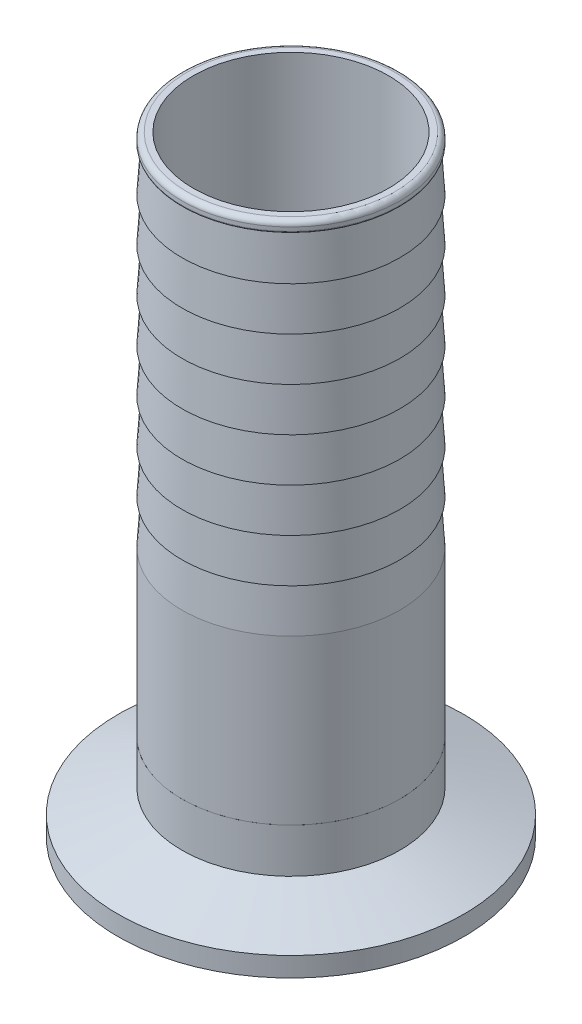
ISO-10303-21;
HEADER;
FILE_DESCRIPTION(('STEP AP214'),'2;1');
FILE_NAME('part.step','',(''),(''),'','','');
FILE_SCHEMA(('AUTOMOTIVE_DESIGN { 1 0 10303 214 1 1 1 1 }'));
ENDSEC;
DATA;
#1=APPLICATION_CONTEXT('core data for automotive mechanical design processes');
#2=APPLICATION_PROTOCOL_DEFINITION('international standard','automotive_design',2000,#1);
#3=PRODUCT_CONTEXT('',#1,'mechanical');
#4=PRODUCT('Part','Part','',(#3));
#5=PRODUCT_RELATED_PRODUCT_CATEGORY('part','',(#4));
#6=PRODUCT_DEFINITION_FORMATION('','',#4);
#7=PRODUCT_DEFINITION_CONTEXT('part definition',#1,'design');
#8=PRODUCT_DEFINITION('design','',#6,#7);
#9=PRODUCT_DEFINITION_SHAPE('','',#8);
#10=(LENGTH_UNIT() NAMED_UNIT(*) SI_UNIT(.MILLI.,.METRE.));
#11=(NAMED_UNIT(*) PLANE_ANGLE_UNIT() SI_UNIT($,.RADIAN.));
#12=(NAMED_UNIT(*) SI_UNIT($,.STERADIAN.) SOLID_ANGLE_UNIT());
#13=UNCERTAINTY_MEASURE_WITH_UNIT(LENGTH_MEASURE(1.E-05),#10,'distance_accuracy_value','');
#14=(GEOMETRIC_REPRESENTATION_CONTEXT(3) GLOBAL_UNCERTAINTY_ASSIGNED_CONTEXT((#13)) GLOBAL_UNIT_ASSIGNED_CONTEXT((#10,
#11,#12)) REPRESENTATION_CONTEXT('',''));
#15=CARTESIAN_POINT('',(0.,0.,0.));
#16=DIRECTION('',(0.,0.,1.));
#17=DIRECTION('',(1.,0.,0.));
#18=AXIS2_PLACEMENT_3D('',#15,#16,#17);
#19=CARTESIAN_POINT('',(22.5114267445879,21.9287540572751,40.3655220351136));
#20=DIRECTION('',(0.,1.,0.));
#21=DIRECTION('',(0.,0.,1.));
#22=AXIS2_PLACEMENT_3D('',#19,#20,#21);
#23=CONICAL_SURFACE('',#22,20.9336326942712,0.401425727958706);
#24=CARTESIAN_POINT('',(22.5114267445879,21.4090179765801,40.3655220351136));
#25=DIRECTION('',(0.,-1.,0.));
#26=DIRECTION('',(0.,0.,-1.));
#27=AXIS2_PLACEMENT_3D('',#24,#25,#26);
#28=CIRCLE('',#27,20.7130178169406);
#29=CARTESIAN_POINT('',(22.5114267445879,21.4090179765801,19.652504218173));
#30=VERTEX_POINT('',#29);
#31=EDGE_CURVE('P0_E10',#30,#30,#28,.T.);
#32=ORIENTED_EDGE('',*,*,#31,.F.);
#33=EDGE_LOOP('',(#32));
#34=FACE_BOUND('',#33,.T.);
#35=CARTESIAN_POINT('',(22.5114267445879,21.9287540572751,40.3655220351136));
#36=DIRECTION('',(0.,-1.,0.));
#37=DIRECTION('',(0.,0.,-1.));
#38=AXIS2_PLACEMENT_3D('',#35,#36,#37);
#39=CIRCLE('',#38,20.9336326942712);
#40=CARTESIAN_POINT('',(22.5114267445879,21.9287540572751,19.4318893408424));
#41=VERTEX_POINT('',#40);
#42=EDGE_CURVE('P0_E55',#41,#41,#39,.T.);
#43=ORIENTED_EDGE('',*,*,#42,.T.);
#44=EDGE_LOOP('',(#43));
#45=FACE_BOUND('',#44,.T.);
#46=ADVANCED_FACE('P0_F15',(#34,#45),#23,.T.);
#47=CARTESIAN_POINT('',(22.5114267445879,21.7067550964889,40.3655220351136));
#48=DIRECTION('',(0.,-1.,0.));
#49=DIRECTION('',(0.,0.,-1.));
#50=AXIS2_PLACEMENT_3D('',#47,#48,#49);
#51=TOROIDAL_SURFACE('',#50,20.0115931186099,0.761999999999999);
#52=CARTESIAN_POINT('',(22.5114267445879,20.9447550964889,40.3655220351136));
#53=DIRECTION('',(0.,-1.,0.));
#54=DIRECTION('',(0.,0.,-1.));
#55=AXIS2_PLACEMENT_3D('',#52,#53,#54);
#56=CIRCLE('',#55,20.0115931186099);
#57=CARTESIAN_POINT('',(22.5114267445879,20.9447550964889,20.3539289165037));
#58=VERTEX_POINT('',#57);
#59=EDGE_CURVE('P0_E21',#58,#58,#56,.T.);
#60=ORIENTED_EDGE('',*,*,#59,.F.);
#61=EDGE_LOOP('',(#60));
#62=FACE_BOUND('',#61,.T.);
#63=ORIENTED_EDGE('',*,*,#31,.T.);
#64=EDGE_LOOP('',(#63));
#65=FACE_BOUND('',#64,.T.);
#66=ADVANCED_FACE('P0_F85',(#62,#65),#51,.T.);
#67=CARTESIAN_POINT('',(22.5114267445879,20.9447550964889,40.3655220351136));
#68=DIRECTION('',(0.,1.,0.));
#69=DIRECTION('',(0.,0.,1.));
#70=AXIS2_PLACEMENT_3D('',#67,#68,#69);
#71=PLANE('',#70);
#72=CARTESIAN_POINT('',(22.5114267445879,20.9447550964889,40.3655220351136));
#73=DIRECTION('',(0.,-1.,0.));
#74=DIRECTION('',(0.,0.,-1.));
#75=AXIS2_PLACEMENT_3D('',#72,#73,#74);
#76=CIRCLE('',#75,14.224);
#77=CARTESIAN_POINT('',(22.5114267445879,20.9447550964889,26.1415220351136));
#78=VERTEX_POINT('',#77);
#79=EDGE_CURVE('P0_E25',#78,#78,#76,.T.);
#80=ORIENTED_EDGE('',*,*,#79,.F.);
#81=EDGE_LOOP('',(#80));
#82=FACE_BOUND('',#81,.T.);
#83=ORIENTED_EDGE('',*,*,#59,.T.);
#84=EDGE_LOOP('',(#83));
#85=FACE_BOUND('',#84,.T.);
#86=ADVANCED_FACE('P0_F90',(#82,#85),#71,.F.);
#87=CARTESIAN_POINT('',(22.5114267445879,20.9447550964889,40.3655220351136));
#88=DIRECTION('',(0.,-1.,0.));
#89=DIRECTION('',(0.,0.,-1.));
#90=AXIS2_PLACEMENT_3D('',#87,#88,#89);
#91=CYLINDRICAL_SURFACE('',#90,14.224);
#92=ORIENTED_EDGE('',*,*,#79,.T.);
#93=EDGE_LOOP('',(#92));
#94=FACE_BOUND('',#93,.T.);
#95=CARTESIAN_POINT('',(22.5114267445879,33.6447550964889,40.3655220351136));
#96=DIRECTION('',(0.,-1.,0.));
#97=DIRECTION('',(0.,0.,-1.));
#98=AXIS2_PLACEMENT_3D('',#95,#96,#97);
#99=CIRCLE('',#98,14.224);
#100=CARTESIAN_POINT('',(22.5114267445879,33.6447550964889,26.1415220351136));
#101=VERTEX_POINT('',#100);
#102=EDGE_CURVE('P0_E29',#101,#101,#99,.T.);
#103=ORIENTED_EDGE('',*,*,#102,.F.);
#104=EDGE_LOOP('',(#103));
#105=FACE_BOUND('',#104,.T.);
#106=ADVANCED_FACE('P0_F95',(#94,#105),#91,.F.);
#107=CARTESIAN_POINT('',(22.5114267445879,33.6447550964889,40.3655220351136));
#108=DIRECTION('',(0.,-1.,0.));
#109=DIRECTION('',(0.,0.,-1.));
#110=AXIS2_PLACEMENT_3D('',#107,#108,#109);
#111=PLANE('',#110);
#112=CARTESIAN_POINT('',(22.5114267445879,33.6447550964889,40.3655220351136));
#113=DIRECTION('',(0.,-1.,0.));
#114=DIRECTION('',(0.,0.,-1.));
#115=AXIS2_PLACEMENT_3D('',#112,#113,#114);
#116=CIRCLE('',#115,15.875);
#117=CARTESIAN_POINT('',(22.5114267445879,33.6447550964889,24.4905220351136));
#118=VERTEX_POINT('',#117);
#119=EDGE_CURVE('P0_E34',#118,#118,#116,.T.);
#120=ORIENTED_EDGE('',*,*,#119,.F.);
#121=EDGE_LOOP('',(#120));
#122=FACE_BOUND('',#121,.T.);
#123=ORIENTED_EDGE('',*,*,#102,.T.);
#124=EDGE_LOOP('',(#123));
#125=FACE_BOUND('',#124,.T.);
#126=ADVANCED_FACE('P0_F101',(#122,#125),#111,.F.);
#127=CARTESIAN_POINT('',(22.5114267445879,20.9447550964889,40.3655220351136));
#128=DIRECTION('',(0.,-1.,0.));
#129=DIRECTION('',(0.,0.,-1.));
#130=AXIS2_PLACEMENT_3D('',#127,#128,#129);
#131=CYLINDRICAL_SURFACE('',#130,15.875);
#132=CARTESIAN_POINT('',(22.5114267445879,27.1824128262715,40.3655220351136));
#133=DIRECTION('',(0.,-1.,0.));
#134=DIRECTION('',(0.,0.,-1.));
#135=AXIS2_PLACEMENT_3D('',#132,#133,#134);
#136=CIRCLE('',#135,15.875);
#137=CARTESIAN_POINT('',(22.5114267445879,27.1824128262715,24.4905220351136));
#138=VERTEX_POINT('',#137);
#139=EDGE_CURVE('P0_E37',#138,#138,#136,.T.);
#140=ORIENTED_EDGE('',*,*,#139,.F.);
#141=EDGE_LOOP('',(#140));
#142=FACE_BOUND('',#141,.T.);
#143=ORIENTED_EDGE('',*,*,#119,.T.);
#144=EDGE_LOOP('',(#143));
#145=FACE_BOUND('',#144,.T.);
#146=ADVANCED_FACE('P0_F105',(#142,#145),#131,.T.);
#147=CARTESIAN_POINT('',(22.5114267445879,27.1824128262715,40.3655220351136));
#148=DIRECTION('',(0.,-1.,0.));
#149=DIRECTION('',(0.,0.,-1.));
#150=AXIS2_PLACEMENT_3D('',#147,#148,#149);
#151=CONICAL_SURFACE('',#150,15.875,1.22173047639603);
#152=CARTESIAN_POINT('',(22.5114267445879,23.7895550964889,40.3655220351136));
#153=DIRECTION('',(0.,-1.,0.));
#154=DIRECTION('',(0.,0.,-1.));
#155=AXIS2_PLACEMENT_3D('',#152,#153,#154);
#156=CIRCLE('',#155,25.1968);
#157=CARTESIAN_POINT('',(22.5114267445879,23.7895550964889,15.1687220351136));
#158=VERTEX_POINT('',#157);
#159=EDGE_CURVE('P0_E40',#158,#158,#156,.T.);
#160=ORIENTED_EDGE('',*,*,#159,.F.);
#161=EDGE_LOOP('',(#160));
#162=FACE_BOUND('',#161,.T.);
#163=ORIENTED_EDGE('',*,*,#139,.T.);
#164=EDGE_LOOP('',(#163));
#165=FACE_BOUND('',#164,.T.);
#166=ADVANCED_FACE('P0_F109',(#162,#165),#151,.T.);
#167=CARTESIAN_POINT('',(22.5114267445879,20.9447550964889,40.3655220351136));
#168=DIRECTION('',(0.,-1.,0.));
#169=DIRECTION('',(0.,0.,-1.));
#170=AXIS2_PLACEMENT_3D('',#167,#168,#169);
#171=CYLINDRICAL_SURFACE('',#170,25.1968);
#172=CARTESIAN_POINT('',(22.5114267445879,20.9447550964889,40.3655220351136));
#173=DIRECTION('',(0.,-1.,0.));
#174=DIRECTION('',(0.,0.,-1.));
#175=AXIS2_PLACEMENT_3D('',#172,#173,#174);
#176=CIRCLE('',#175,25.1968);
#177=CARTESIAN_POINT('',(22.5114267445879,20.9447550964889,15.1687220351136));
#178=VERTEX_POINT('',#177);
#179=EDGE_CURVE('P0_E43',#178,#178,#176,.T.);
#180=ORIENTED_EDGE('',*,*,#179,.F.);
#181=EDGE_LOOP('',(#180));
#182=FACE_BOUND('',#181,.T.);
#183=ORIENTED_EDGE('',*,*,#159,.T.);
#184=EDGE_LOOP('',(#183));
#185=FACE_BOUND('',#184,.T.);
#186=ADVANCED_FACE('P0_F81',(#182,#185),#171,.T.);
#187=CARTESIAN_POINT('',(22.5114267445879,20.9447550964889,40.3655220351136));
#188=DIRECTION('',(0.,1.,0.));
#189=DIRECTION('',(0.,0.,1.));
#190=AXIS2_PLACEMENT_3D('',#187,#188,#189);
#191=PLANE('',#190);
#192=CARTESIAN_POINT('',(22.5114267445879,20.9447550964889,40.3655220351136));
#193=DIRECTION('',(0.,-1.,0.));
#194=DIRECTION('',(0.,0.,-1.));
#195=AXIS2_PLACEMENT_3D('',#192,#193,#194);
#196=CIRCLE('',#195,23.9521599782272);
#197=CARTESIAN_POINT('',(22.5114267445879,20.9447550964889,16.4133620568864));
#198=VERTEX_POINT('',#197);
#199=EDGE_CURVE('P0_E46',#198,#198,#196,.T.);
#200=ORIENTED_EDGE('',*,*,#199,.F.);
#201=EDGE_LOOP('',(#200));
#202=FACE_BOUND('',#201,.T.);
#203=ORIENTED_EDGE('',*,*,#179,.T.);
#204=EDGE_LOOP('',(#203));
#205=FACE_BOUND('',#204,.T.);
#206=ADVANCED_FACE('P0_F74',(#202,#205),#191,.F.);
#207=CARTESIAN_POINT('',(22.5114267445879,21.7067550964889,40.3655220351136));
#208=DIRECTION('',(0.,-1.,0.));
#209=DIRECTION('',(0.,0.,-1.));
#210=AXIS2_PLACEMENT_3D('',#207,#208,#209);
#211=TOROIDAL_SURFACE('',#210,23.9521599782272,0.761999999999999);
#212=ORIENTED_EDGE('',*,*,#199,.T.);
#213=EDGE_LOOP('',(#212));
#214=FACE_BOUND('',#213,.T.);
#215=CARTESIAN_POINT('',(22.5114267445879,21.4090179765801,40.3655220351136));
#216=DIRECTION('',(0.,-1.,0.));
#217=DIRECTION('',(0.,0.,-1.));
#218=AXIS2_PLACEMENT_3D('',#215,#216,#217);
#219=CIRCLE('',#218,23.2507352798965);
#220=CARTESIAN_POINT('',(22.5114267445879,21.4090179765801,17.1147867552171));
#221=VERTEX_POINT('',#220);
#222=EDGE_CURVE('P0_E49',#221,#221,#219,.T.);
#223=ORIENTED_EDGE('',*,*,#222,.F.);
#224=EDGE_LOOP('',(#223));
#225=FACE_BOUND('',#224,.T.);
#226=ADVANCED_FACE('P0_F69',(#214,#225),#211,.T.);
#227=CARTESIAN_POINT('',(22.5114267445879,21.4090179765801,40.3655220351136));
#228=DIRECTION('',(0.,-1.,0.));
#229=DIRECTION('',(0.,0.,-1.));
#230=AXIS2_PLACEMENT_3D('',#227,#228,#229);
#231=CONICAL_SURFACE('',#230,23.2507352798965,0.401425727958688);
#232=CARTESIAN_POINT('',(22.5114267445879,21.8176099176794,40.3655220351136));
#233=DIRECTION('',(0.,-1.,0.));
#234=DIRECTION('',(0.,0.,-1.));
#235=AXIS2_PLACEMENT_3D('',#232,#233,#234);
#236=CIRCLE('',#235,23.0772982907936);
#237=CARTESIAN_POINT('',(22.5114267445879,21.8176099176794,17.28822374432));
#238=VERTEX_POINT('',#237);
#239=EDGE_CURVE('P0_E52',#238,#238,#236,.T.);
#240=ORIENTED_EDGE('',*,*,#239,.F.);
#241=EDGE_LOOP('',(#240));
#242=FACE_BOUND('',#241,.T.);
#243=ORIENTED_EDGE('',*,*,#222,.T.);
#244=EDGE_LOOP('',(#243));
#245=FACE_BOUND('',#244,.T.);
#246=ADVANCED_FACE('P0_F63',(#242,#245),#231,.F.);
#247=CARTESIAN_POINT('',(22.5114267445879,21.3511550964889,40.3655220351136));
#248=DIRECTION('',(0.,-1.,0.));
#249=DIRECTION('',(0.,0.,-1.));
#250=AXIS2_PLACEMENT_3D('',#247,#248,#249);
#251=TOROIDAL_SURFACE('',#250,21.9783995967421,1.1938);
#252=ORIENTED_EDGE('',*,*,#42,.F.);
#253=EDGE_LOOP('',(#252));
#254=FACE_BOUND('',#253,.T.);
#255=ORIENTED_EDGE('',*,*,#239,.T.);
#256=EDGE_LOOP('',(#255));
#257=FACE_BOUND('',#256,.T.);
#258=ADVANCED_FACE('P0_F60',(#254,#257),#251,.F.);
#259=CLOSED_SHELL('',(#46,#66,#86,#106,#126,#146,#166,#186,#206,#226,#246,#258));
#260=MANIFOLD_SOLID_BREP('P0_B1',#259);
#261=CARTESIAN_POINT('',(22.5114267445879,109.082755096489,40.3655220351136));
#262=DIRECTION('',(0.,-1.,0.));
#263=DIRECTION('',(0.475456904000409,0.,-0.879739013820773));
#264=AXIS2_PLACEMENT_3D('',#261,#262,#263);
#265=TOROIDAL_SURFACE('',#264,15.113,0.762000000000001);
#266=CARTESIAN_POINT('',(22.5114267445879,109.844755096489,40.3655220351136));
#267=DIRECTION('',(0.,-1.,0.));
#268=DIRECTION('',(0.475456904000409,0.,-0.879739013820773));
#269=AXIS2_PLACEMENT_3D('',#266,#267,#268);
#270=CIRCLE('',#269,15.113);
#271=CARTESIAN_POINT('',(29.6970069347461,109.844755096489,27.0700263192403));
#272=VERTEX_POINT('',#271);
#273=EDGE_CURVE('P1_E9',#272,#272,#270,.T.);
#274=ORIENTED_EDGE('',*,*,#273,.T.);
#275=EDGE_LOOP('',(#274));
#276=FACE_BOUND('',#275,.T.);
#277=CARTESIAN_POINT('',(22.5114267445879,109.082755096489,40.3655220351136));
#278=DIRECTION('',(0.,-1.,0.));
#279=DIRECTION('',(0.475456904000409,0.,-0.879739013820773));
#280=AXIS2_PLACEMENT_3D('',#277,#278,#279);
#281=CIRCLE('',#280,15.875);
#282=CARTESIAN_POINT('',(30.0593050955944,109.082755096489,26.3996651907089));
#283=VERTEX_POINT('',#282);
#284=EDGE_CURVE('P1_E87',#283,#283,#281,.T.);
#285=ORIENTED_EDGE('',*,*,#284,.F.);
#286=EDGE_LOOP('',(#285));
#287=FACE_BOUND('',#286,.T.);
#288=ADVANCED_FACE('P1_F14',(#276,#287),#265,.T.);
#289=CARTESIAN_POINT('',(35.0248344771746,109.844755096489,47.1284210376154));
#290=DIRECTION('',(0.,1.,0.));
#291=DIRECTION('',(-0.475456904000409,0.,0.879739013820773));
#292=AXIS2_PLACEMENT_3D('',#289,#290,#291);
#293=PLANE('',#292);
#294=CARTESIAN_POINT('',(22.5114267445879,109.844755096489,40.3655220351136));
#295=DIRECTION('',(0.,-1.,0.));
#296=DIRECTION('',(0.475456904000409,0.,-0.879739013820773));
#297=AXIS2_PLACEMENT_3D('',#294,#295,#296);
#298=CIRCLE('',#297,14.224);
#299=CARTESIAN_POINT('',(29.2743257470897,109.844755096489,27.852114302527));
#300=VERTEX_POINT('',#299);
#301=EDGE_CURVE('P1_E20',#300,#300,#298,.T.);
#302=ORIENTED_EDGE('',*,*,#301,.T.);
#303=EDGE_LOOP('',(#302));
#304=FACE_BOUND('',#303,.T.);
#305=ORIENTED_EDGE('',*,*,#273,.F.);
#306=EDGE_LOOP('',(#305));
#307=FACE_BOUND('',#306,.T.);
#308=ADVANCED_FACE('P1_F95',(#304,#307),#293,.T.);
#309=CARTESIAN_POINT('',(22.5114267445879,33.6447550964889,40.3655220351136));
#310=DIRECTION('',(0.,-1.,0.));
#311=DIRECTION('',(0.475456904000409,0.,-0.879739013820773));
#312=AXIS2_PLACEMENT_3D('',#309,#310,#311);
#313=CYLINDRICAL_SURFACE('',#312,14.224);
#314=CARTESIAN_POINT('',(22.5114267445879,33.6447550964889,40.3655220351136));
#315=DIRECTION('',(0.,-1.,0.));
#316=DIRECTION('',(0.475456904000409,0.,-0.879739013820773));
#317=AXIS2_PLACEMENT_3D('',#314,#315,#316);
#318=CIRCLE('',#317,14.224);
#319=CARTESIAN_POINT('',(29.2743257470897,33.6447550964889,27.852114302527));
#320=VERTEX_POINT('',#319);
#321=EDGE_CURVE('P1_E24',#320,#320,#318,.T.);
#322=ORIENTED_EDGE('',*,*,#321,.T.);
#323=EDGE_LOOP('',(#322));
#324=FACE_BOUND('',#323,.T.);
#325=ORIENTED_EDGE('',*,*,#301,.F.);
#326=EDGE_LOOP('',(#325));
#327=FACE_BOUND('',#326,.T.);
#328=ADVANCED_FACE('P1_F100',(#324,#327),#313,.F.);
#329=CARTESIAN_POINT('',(36.4772835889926,33.6447550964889,47.9134003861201));
#330=DIRECTION('',(0.,-1.,0.));
#331=DIRECTION('',(0.475456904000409,0.,-0.879739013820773));
#332=AXIS2_PLACEMENT_3D('',#329,#330,#331);
#333=PLANE('',#332);
#334=CARTESIAN_POINT('',(22.5114267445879,33.6447550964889,40.3655220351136));
#335=DIRECTION('',(0.,-1.,0.));
#336=DIRECTION('',(0.475456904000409,0.,-0.879739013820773));
#337=AXIS2_PLACEMENT_3D('',#334,#335,#336);
#338=CIRCLE('',#337,15.875);
#339=CARTESIAN_POINT('',(30.0593050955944,33.6447550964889,26.3996651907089));
#340=VERTEX_POINT('',#339);
#341=EDGE_CURVE('P1_E28',#340,#340,#338,.T.);
#342=ORIENTED_EDGE('',*,*,#341,.T.);
#343=EDGE_LOOP('',(#342));
#344=FACE_BOUND('',#343,.T.);
#345=ORIENTED_EDGE('',*,*,#321,.F.);
#346=EDGE_LOOP('',(#345));
#347=FACE_BOUND('',#346,.T.);
#348=ADVANCED_FACE('P1_F104',(#344,#347),#333,.T.);
#349=CARTESIAN_POINT('',(22.5114267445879,33.6447550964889,40.3655220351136));
#350=DIRECTION('',(0.,-1.,0.));
#351=DIRECTION('',(0.475456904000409,0.,-0.879739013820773));
#352=AXIS2_PLACEMENT_3D('',#349,#350,#351);
#353=CYLINDRICAL_SURFACE('',#352,15.875);
#354=CARTESIAN_POINT('',(22.5114267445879,57.4699550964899,40.3655220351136));
#355=DIRECTION('',(0.,-1.,0.));
#356=DIRECTION('',(0.475456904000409,0.,-0.879739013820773));
#357=AXIS2_PLACEMENT_3D('',#354,#355,#356);
#358=CIRCLE('',#357,15.875);
#359=CARTESIAN_POINT('',(30.0593050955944,57.4699550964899,26.3996651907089));
#360=VERTEX_POINT('',#359);
#361=EDGE_CURVE('P1_E33',#360,#360,#358,.T.);
#362=ORIENTED_EDGE('',*,*,#361,.T.);
#363=EDGE_LOOP('',(#362));
#364=FACE_BOUND('',#363,.T.);
#365=ORIENTED_EDGE('',*,*,#341,.F.);
#366=EDGE_LOOP('',(#365));
#367=FACE_BOUND('',#366,.T.);
#368=ADVANCED_FACE('P1_F111',(#364,#367),#353,.T.);
#369=CARTESIAN_POINT('',(22.5114267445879,57.4699550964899,40.3655220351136));
#370=DIRECTION('',(0.,-1.,0.));
#371=DIRECTION('',(0.475456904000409,0.,-0.879739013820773));
#372=AXIS2_PLACEMENT_3D('',#369,#370,#371);
#373=CONICAL_SURFACE('',#372,15.875,0.0599281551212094);
#374=CARTESIAN_POINT('',(22.5114267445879,63.8199550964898,40.3655220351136));
#375=DIRECTION('',(0.,-1.,0.));
#376=DIRECTION('',(0.475456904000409,0.,-0.879739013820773));
#377=AXIS2_PLACEMENT_3D('',#374,#375,#376);
#378=CIRCLE('',#377,15.494);
#379=CARTESIAN_POINT('',(29.8781560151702,63.8199550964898,26.7348457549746));
#380=VERTEX_POINT('',#379);
#381=EDGE_CURVE('P1_E36',#380,#380,#378,.T.);
#382=ORIENTED_EDGE('',*,*,#381,.T.);
#383=EDGE_LOOP('',(#382));
#384=FACE_BOUND('',#383,.T.);
#385=ORIENTED_EDGE('',*,*,#361,.F.);
#386=EDGE_LOOP('',(#385));
#387=FACE_BOUND('',#386,.T.);
#388=ADVANCED_FACE('P1_F115',(#384,#387),#373,.T.);
#389=CARTESIAN_POINT('',(36.4772835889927,63.8199550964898,47.9134003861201));
#390=DIRECTION('',(0.,-1.,0.));
#391=DIRECTION('',(0.475456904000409,0.,-0.879739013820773));
#392=AXIS2_PLACEMENT_3D('',#389,#390,#391);
#393=PLANE('',#392);
#394=CARTESIAN_POINT('',(22.5114267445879,63.8199550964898,40.3655220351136));
#395=DIRECTION('',(0.,-1.,0.));
#396=DIRECTION('',(0.475456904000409,0.,-0.879739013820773));
#397=AXIS2_PLACEMENT_3D('',#394,#395,#396);
#398=CIRCLE('',#397,15.875);
#399=CARTESIAN_POINT('',(30.0593050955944,63.8199550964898,26.3996651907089));
#400=VERTEX_POINT('',#399);
#401=EDGE_CURVE('P1_E39',#400,#400,#398,.T.);
#402=ORIENTED_EDGE('',*,*,#401,.T.);
#403=EDGE_LOOP('',(#402));
#404=FACE_BOUND('',#403,.T.);
#405=ORIENTED_EDGE('',*,*,#381,.F.);
#406=EDGE_LOOP('',(#405));
#407=FACE_BOUND('',#406,.T.);
#408=ADVANCED_FACE('P1_F119',(#404,#407),#393,.T.);
#409=CARTESIAN_POINT('',(22.5114267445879,63.8199550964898,40.3655220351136));
#410=DIRECTION('',(0.,-1.,0.));
#411=DIRECTION('',(0.475456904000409,0.,-0.879739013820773));
#412=AXIS2_PLACEMENT_3D('',#409,#410,#411);
#413=CONICAL_SURFACE('',#412,15.875,0.059928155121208);
#414=CARTESIAN_POINT('',(22.5114267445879,70.1699550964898,40.3655220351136));
#415=DIRECTION('',(0.,-1.,0.));
#416=DIRECTION('',(0.475456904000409,0.,-0.879739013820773));
#417=AXIS2_PLACEMENT_3D('',#414,#415,#416);
#418=CIRCLE('',#417,15.494);
#419=CARTESIAN_POINT('',(29.8781560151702,70.1699550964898,26.7348457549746));
#420=VERTEX_POINT('',#419);
#421=EDGE_CURVE('P1_E42',#420,#420,#418,.T.);
#422=ORIENTED_EDGE('',*,*,#421,.T.);
#423=EDGE_LOOP('',(#422));
#424=FACE_BOUND('',#423,.T.);
#425=ORIENTED_EDGE('',*,*,#401,.F.);
#426=EDGE_LOOP('',(#425));
#427=FACE_BOUND('',#426,.T.);
#428=ADVANCED_FACE('P1_F123',(#424,#427),#413,.T.);
#429=CARTESIAN_POINT('',(36.4772835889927,70.1699550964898,47.9134003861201));
#430=DIRECTION('',(0.,-1.,0.));
#431=DIRECTION('',(0.475456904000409,0.,-0.879739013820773));
#432=AXIS2_PLACEMENT_3D('',#429,#430,#431);
#433=PLANE('',#432);
#434=CARTESIAN_POINT('',(22.5114267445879,70.1699550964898,40.3655220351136));
#435=DIRECTION('',(0.,-1.,0.));
#436=DIRECTION('',(0.475456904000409,0.,-0.879739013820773));
#437=AXIS2_PLACEMENT_3D('',#434,#435,#436);
#438=CIRCLE('',#437,15.875);
#439=CARTESIAN_POINT('',(30.0593050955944,70.1699550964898,26.3996651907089));
#440=VERTEX_POINT('',#439);
#441=EDGE_CURVE('P1_E45',#440,#440,#438,.T.);
#442=ORIENTED_EDGE('',*,*,#441,.T.);
#443=EDGE_LOOP('',(#442));
#444=FACE_BOUND('',#443,.T.);
#445=ORIENTED_EDGE('',*,*,#421,.F.);
#446=EDGE_LOOP('',(#445));
#447=FACE_BOUND('',#446,.T.);
#448=ADVANCED_FACE('P1_F127',(#444,#447),#433,.T.);
#449=CARTESIAN_POINT('',(22.5114267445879,70.1699550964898,40.3655220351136));
#450=DIRECTION('',(0.,-1.,0.));
#451=DIRECTION('',(0.475456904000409,0.,-0.879739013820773));
#452=AXIS2_PLACEMENT_3D('',#449,#450,#451);
#453=CONICAL_SURFACE('',#452,15.875,0.0599281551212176);
#454=CARTESIAN_POINT('',(22.5114267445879,76.5199550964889,40.3655220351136));
#455=DIRECTION('',(0.,-1.,0.));
#456=DIRECTION('',(0.475456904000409,0.,-0.879739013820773));
#457=AXIS2_PLACEMENT_3D('',#454,#455,#456);
#458=CIRCLE('',#457,15.494);
#459=CARTESIAN_POINT('',(29.8781560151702,76.5199550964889,26.7348457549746));
#460=VERTEX_POINT('',#459);
#461=EDGE_CURVE('P1_E48',#460,#460,#458,.T.);
#462=ORIENTED_EDGE('',*,*,#461,.T.);
#463=EDGE_LOOP('',(#462));
#464=FACE_BOUND('',#463,.T.);
#465=ORIENTED_EDGE('',*,*,#441,.F.);
#466=EDGE_LOOP('',(#465));
#467=FACE_BOUND('',#466,.T.);
#468=ADVANCED_FACE('P1_F131',(#464,#467),#453,.T.);
#469=CARTESIAN_POINT('',(36.4772835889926,76.5199550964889,47.9134003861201));
#470=DIRECTION('',(0.,-1.,0.));
#471=DIRECTION('',(0.475456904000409,0.,-0.879739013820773));
#472=AXIS2_PLACEMENT_3D('',#469,#470,#471);
#473=PLANE('',#472);
#474=CARTESIAN_POINT('',(22.5114267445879,76.5199550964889,40.3655220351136));
#475=DIRECTION('',(0.,-1.,0.));
#476=DIRECTION('',(0.475456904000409,0.,-0.879739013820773));
#477=AXIS2_PLACEMENT_3D('',#474,#475,#476);
#478=CIRCLE('',#477,15.875);
#479=CARTESIAN_POINT('',(30.0593050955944,76.5199550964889,26.3996651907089));
#480=VERTEX_POINT('',#479);
#481=EDGE_CURVE('P1_E51',#480,#480,#478,.T.);
#482=ORIENTED_EDGE('',*,*,#481,.T.);
#483=EDGE_LOOP('',(#482));
#484=FACE_BOUND('',#483,.T.);
#485=ORIENTED_EDGE('',*,*,#461,.F.);
#486=EDGE_LOOP('',(#485));
#487=FACE_BOUND('',#486,.T.);
#488=ADVANCED_FACE('P1_F135',(#484,#487),#473,.T.);
#489=CARTESIAN_POINT('',(22.5114267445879,76.5199550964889,40.3655220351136));
#490=DIRECTION('',(0.,-1.,0.));
#491=DIRECTION('',(0.475456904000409,0.,-0.879739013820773));
#492=AXIS2_PLACEMENT_3D('',#489,#490,#491);
#493=CONICAL_SURFACE('',#492,15.875,0.0599281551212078);
#494=CARTESIAN_POINT('',(22.5114267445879,82.8699550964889,40.3655220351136));
#495=DIRECTION('',(0.,-1.,0.));
#496=DIRECTION('',(0.475456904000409,0.,-0.879739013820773));
#497=AXIS2_PLACEMENT_3D('',#494,#495,#496);
#498=CIRCLE('',#497,15.494);
#499=CARTESIAN_POINT('',(29.8781560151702,82.8699550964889,26.7348457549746));
#500=VERTEX_POINT('',#499);
#501=EDGE_CURVE('P1_E54',#500,#500,#498,.T.);
#502=ORIENTED_EDGE('',*,*,#501,.T.);
#503=EDGE_LOOP('',(#502));
#504=FACE_BOUND('',#503,.T.);
#505=ORIENTED_EDGE('',*,*,#481,.F.);
#506=EDGE_LOOP('',(#505));
#507=FACE_BOUND('',#506,.T.);
#508=ADVANCED_FACE('P1_F139',(#504,#507),#493,.T.);
#509=CARTESIAN_POINT('',(36.4772835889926,82.8699550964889,47.9134003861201));
#510=DIRECTION('',(0.,-1.,0.));
#511=DIRECTION('',(0.475456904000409,0.,-0.879739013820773));
#512=AXIS2_PLACEMENT_3D('',#509,#510,#511);
#513=PLANE('',#512);
#514=CARTESIAN_POINT('',(22.5114267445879,82.8699550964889,40.3655220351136));
#515=DIRECTION('',(0.,-1.,0.));
#516=DIRECTION('',(0.475456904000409,0.,-0.879739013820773));
#517=AXIS2_PLACEMENT_3D('',#514,#515,#516);
#518=CIRCLE('',#517,15.875);
#519=CARTESIAN_POINT('',(30.0593050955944,82.8699550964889,26.3996651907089));
#520=VERTEX_POINT('',#519);
#521=EDGE_CURVE('P1_E57',#520,#520,#518,.T.);
#522=ORIENTED_EDGE('',*,*,#521,.T.);
#523=EDGE_LOOP('',(#522));
#524=FACE_BOUND('',#523,.T.);
#525=ORIENTED_EDGE('',*,*,#501,.F.);
#526=EDGE_LOOP('',(#525));
#527=FACE_BOUND('',#526,.T.);
#528=ADVANCED_FACE('P1_F143',(#524,#527),#513,.T.);
#529=CARTESIAN_POINT('',(22.5114267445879,82.8699550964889,40.3655220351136));
#530=DIRECTION('',(0.,-1.,0.));
#531=DIRECTION('',(0.475456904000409,0.,-0.879739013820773));
#532=AXIS2_PLACEMENT_3D('',#529,#530,#531);
#533=CONICAL_SURFACE('',#532,15.875,0.0599281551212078);
#534=CARTESIAN_POINT('',(22.5114267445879,89.2199550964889,40.3655220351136));
#535=DIRECTION('',(0.,-1.,0.));
#536=DIRECTION('',(0.475456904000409,0.,-0.879739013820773));
#537=AXIS2_PLACEMENT_3D('',#534,#535,#536);
#538=CIRCLE('',#537,15.494);
#539=CARTESIAN_POINT('',(29.8781560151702,89.2199550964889,26.7348457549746));
#540=VERTEX_POINT('',#539);
#541=EDGE_CURVE('P1_E60',#540,#540,#538,.T.);
#542=ORIENTED_EDGE('',*,*,#541,.T.);
#543=EDGE_LOOP('',(#542));
#544=FACE_BOUND('',#543,.T.);
#545=ORIENTED_EDGE('',*,*,#521,.F.);
#546=EDGE_LOOP('',(#545));
#547=FACE_BOUND('',#546,.T.);
#548=ADVANCED_FACE('P1_F147',(#544,#547),#533,.T.);
#549=CARTESIAN_POINT('',(36.4772835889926,89.2199550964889,47.9134003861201));
#550=DIRECTION('',(0.,-1.,0.));
#551=DIRECTION('',(0.475456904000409,0.,-0.879739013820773));
#552=AXIS2_PLACEMENT_3D('',#549,#550,#551);
#553=PLANE('',#552);
#554=CARTESIAN_POINT('',(22.5114267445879,89.2199550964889,40.3655220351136));
#555=DIRECTION('',(0.,-1.,0.));
#556=DIRECTION('',(0.475456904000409,0.,-0.879739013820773));
#557=AXIS2_PLACEMENT_3D('',#554,#555,#556);
#558=CIRCLE('',#557,15.875);
#559=CARTESIAN_POINT('',(30.0593050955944,89.2199550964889,26.3996651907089));
#560=VERTEX_POINT('',#559);
#561=EDGE_CURVE('P1_E63',#560,#560,#558,.T.);
#562=ORIENTED_EDGE('',*,*,#561,.T.);
#563=EDGE_LOOP('',(#562));
#564=FACE_BOUND('',#563,.T.);
#565=ORIENTED_EDGE('',*,*,#541,.F.);
#566=EDGE_LOOP('',(#565));
#567=FACE_BOUND('',#566,.T.);
#568=ADVANCED_FACE('P1_F151',(#564,#567),#553,.T.);
#569=CARTESIAN_POINT('',(22.5114267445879,89.2199550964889,40.3655220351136));
#570=DIRECTION('',(0.,-1.,0.));
#571=DIRECTION('',(0.475456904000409,0.,-0.879739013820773));
#572=AXIS2_PLACEMENT_3D('',#569,#570,#571);
#573=CONICAL_SURFACE('',#572,15.875,0.0599281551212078);
#574=CARTESIAN_POINT('',(22.5114267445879,95.5699550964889,40.3655220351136));
#575=DIRECTION('',(0.,-1.,0.));
#576=DIRECTION('',(0.475456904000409,0.,-0.879739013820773));
#577=AXIS2_PLACEMENT_3D('',#574,#575,#576);
#578=CIRCLE('',#577,15.494);
#579=CARTESIAN_POINT('',(29.8781560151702,95.5699550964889,26.7348457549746));
#580=VERTEX_POINT('',#579);
#581=EDGE_CURVE('P1_E66',#580,#580,#578,.T.);
#582=ORIENTED_EDGE('',*,*,#581,.T.);
#583=EDGE_LOOP('',(#582));
#584=FACE_BOUND('',#583,.T.);
#585=ORIENTED_EDGE('',*,*,#561,.F.);
#586=EDGE_LOOP('',(#585));
#587=FACE_BOUND('',#586,.T.);
#588=ADVANCED_FACE('P1_F155',(#584,#587),#573,.T.);
#589=CARTESIAN_POINT('',(36.4772835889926,95.5699550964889,47.9134003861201));
#590=DIRECTION('',(0.,-1.,0.));
#591=DIRECTION('',(0.475456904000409,0.,-0.879739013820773));
#592=AXIS2_PLACEMENT_3D('',#589,#590,#591);
#593=PLANE('',#592);
#594=CARTESIAN_POINT('',(22.5114267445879,95.5699550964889,40.3655220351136));
#595=DIRECTION('',(0.,-1.,0.));
#596=DIRECTION('',(0.475456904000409,0.,-0.879739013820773));
#597=AXIS2_PLACEMENT_3D('',#594,#595,#596);
#598=CIRCLE('',#597,15.875);
#599=CARTESIAN_POINT('',(30.0593050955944,95.5699550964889,26.3996651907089));
#600=VERTEX_POINT('',#599);
#601=EDGE_CURVE('P1_E69',#600,#600,#598,.T.);
#602=ORIENTED_EDGE('',*,*,#601,.T.);
#603=EDGE_LOOP('',(#602));
#604=FACE_BOUND('',#603,.T.);
#605=ORIENTED_EDGE('',*,*,#581,.F.);
#606=EDGE_LOOP('',(#605));
#607=FACE_BOUND('',#606,.T.);
#608=ADVANCED_FACE('P1_F159',(#604,#607),#593,.T.);
#609=CARTESIAN_POINT('',(22.5114267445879,95.5699550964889,40.3655220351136));
#610=DIRECTION('',(0.,-1.,0.));
#611=DIRECTION('',(0.475456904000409,0.,-0.879739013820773));
#612=AXIS2_PLACEMENT_3D('',#609,#610,#611);
#613=CONICAL_SURFACE('',#612,15.875,0.0599281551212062);
#614=CARTESIAN_POINT('',(22.5114267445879,101.919955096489,40.3655220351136));
#615=DIRECTION('',(0.,-1.,0.));
#616=DIRECTION('',(0.475456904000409,0.,-0.879739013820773));
#617=AXIS2_PLACEMENT_3D('',#614,#615,#616);
#618=CIRCLE('',#617,15.494);
#619=CARTESIAN_POINT('',(29.8781560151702,101.919955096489,26.7348457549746));
#620=VERTEX_POINT('',#619);
#621=EDGE_CURVE('P1_E72',#620,#620,#618,.T.);
#622=ORIENTED_EDGE('',*,*,#621,.T.);
#623=EDGE_LOOP('',(#622));
#624=FACE_BOUND('',#623,.T.);
#625=ORIENTED_EDGE('',*,*,#601,.F.);
#626=EDGE_LOOP('',(#625));
#627=FACE_BOUND('',#626,.T.);
#628=ADVANCED_FACE('P1_F163',(#624,#627),#613,.T.);
#629=CARTESIAN_POINT('',(36.4772835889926,101.919955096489,47.9134003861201));
#630=DIRECTION('',(0.,-1.,0.));
#631=DIRECTION('',(0.475456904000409,0.,-0.879739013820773));
#632=AXIS2_PLACEMENT_3D('',#629,#630,#631);
#633=PLANE('',#632);
#634=CARTESIAN_POINT('',(22.5114267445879,101.919955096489,40.3655220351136));
#635=DIRECTION('',(0.,-1.,0.));
#636=DIRECTION('',(0.475456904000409,0.,-0.879739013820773));
#637=AXIS2_PLACEMENT_3D('',#634,#635,#636);
#638=CIRCLE('',#637,15.875);
#639=CARTESIAN_POINT('',(30.0593050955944,101.919955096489,26.3996651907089));
#640=VERTEX_POINT('',#639);
#641=EDGE_CURVE('P1_E75',#640,#640,#638,.T.);
#642=ORIENTED_EDGE('',*,*,#641,.T.);
#643=EDGE_LOOP('',(#642));
#644=FACE_BOUND('',#643,.T.);
#645=ORIENTED_EDGE('',*,*,#621,.F.);
#646=EDGE_LOOP('',(#645));
#647=FACE_BOUND('',#646,.T.);
#648=ADVANCED_FACE('P1_F167',(#644,#647),#633,.T.);
#649=CARTESIAN_POINT('',(22.5114267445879,101.919955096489,40.3655220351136));
#650=DIRECTION('',(0.,-1.,0.));
#651=DIRECTION('',(0.475456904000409,0.,-0.879739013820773));
#652=AXIS2_PLACEMENT_3D('',#649,#650,#651);
#653=CONICAL_SURFACE('',#652,15.875,0.0599281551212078);
#654=CARTESIAN_POINT('',(22.5114267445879,108.269955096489,40.3655220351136));
#655=DIRECTION('',(0.,-1.,0.));
#656=DIRECTION('',(0.475456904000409,0.,-0.879739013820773));
#657=AXIS2_PLACEMENT_3D('',#654,#655,#656);
#658=CIRCLE('',#657,15.494);
#659=CARTESIAN_POINT('',(29.8781560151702,108.269955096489,26.7348457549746));
#660=VERTEX_POINT('',#659);
#661=EDGE_CURVE('P1_E78',#660,#660,#658,.T.);
#662=ORIENTED_EDGE('',*,*,#661,.T.);
#663=EDGE_LOOP('',(#662));
#664=FACE_BOUND('',#663,.T.);
#665=ORIENTED_EDGE('',*,*,#641,.F.);
#666=EDGE_LOOP('',(#665));
#667=FACE_BOUND('',#666,.T.);
#668=ADVANCED_FACE('P1_F171',(#664,#667),#653,.T.);
#669=CARTESIAN_POINT('',(36.2538298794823,108.269955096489,47.7926343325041));
#670=DIRECTION('',(0.,-1.,0.));
#671=DIRECTION('',(0.475456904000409,0.,-0.879739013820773));
#672=AXIS2_PLACEMENT_3D('',#669,#670,#671);
#673=PLANE('',#672);
#674=CARTESIAN_POINT('',(22.5114267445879,108.269955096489,40.3655220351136));
#675=DIRECTION('',(0.,-1.,0.));
#676=DIRECTION('',(0.475456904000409,0.,-0.879739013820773));
#677=AXIS2_PLACEMENT_3D('',#674,#675,#676);
#678=CIRCLE('',#677,15.6210000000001);
#679=CARTESIAN_POINT('',(29.9385390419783,108.269955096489,26.6231189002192));
#680=VERTEX_POINT('',#679);
#681=EDGE_CURVE('P1_E81',#680,#680,#678,.T.);
#682=ORIENTED_EDGE('',*,*,#681,.T.);
#683=EDGE_LOOP('',(#682));
#684=FACE_BOUND('',#683,.T.);
#685=ORIENTED_EDGE('',*,*,#661,.F.);
#686=EDGE_LOOP('',(#685));
#687=FACE_BOUND('',#686,.T.);
#688=ADVANCED_FACE('P1_F175',(#684,#687),#673,.T.);
#689=CARTESIAN_POINT('',(22.5114267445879,108.523955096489,40.3655220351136));
#690=DIRECTION('',(0.,-1.,0.));
#691=DIRECTION('',(0.475456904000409,0.,-0.879739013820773));
#692=AXIS2_PLACEMENT_3D('',#689,#690,#691);
#693=TOROIDAL_SURFACE('',#692,15.621,0.254000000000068);
#694=CARTESIAN_POINT('',(22.5114267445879,108.523955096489,40.3655220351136));
#695=DIRECTION('',(0.,-1.,0.));
#696=DIRECTION('',(0.475456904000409,0.,-0.879739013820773));
#697=AXIS2_PLACEMENT_3D('',#694,#695,#696);
#698=CIRCLE('',#697,15.875);
#699=CARTESIAN_POINT('',(30.0593050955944,108.523955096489,26.3996651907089));
#700=VERTEX_POINT('',#699);
#701=EDGE_CURVE('P1_E84',#700,#700,#698,.T.);
#702=ORIENTED_EDGE('',*,*,#701,.T.);
#703=EDGE_LOOP('',(#702));
#704=FACE_BOUND('',#703,.T.);
#705=ORIENTED_EDGE('',*,*,#681,.F.);
#706=EDGE_LOOP('',(#705));
#707=FACE_BOUND('',#706,.T.);
#708=ADVANCED_FACE('P1_F179',(#704,#707),#693,.T.);
#709=CARTESIAN_POINT('',(22.5114267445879,33.6447550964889,40.3655220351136));
#710=DIRECTION('',(0.,-1.,0.));
#711=DIRECTION('',(0.475456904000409,0.,-0.879739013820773));
#712=AXIS2_PLACEMENT_3D('',#709,#710,#711);
#713=CYLINDRICAL_SURFACE('',#712,15.875);
#714=ORIENTED_EDGE('',*,*,#284,.T.);
#715=EDGE_LOOP('',(#714));
#716=FACE_BOUND('',#715,.T.);
#717=ORIENTED_EDGE('',*,*,#701,.F.);
#718=EDGE_LOOP('',(#717));
#719=FACE_BOUND('',#718,.T.);
#720=ADVANCED_FACE('P1_F91',(#716,#719),#713,.T.);
#721=CLOSED_SHELL('',(#288,#308,#328,#348,#368,#388,#408,#428,#448,#468,#488,#508,#528,#548,
#568,#588,#608,#628,#648,#668,#688,#708,#720));
#722=MANIFOLD_SOLID_BREP('P1_B1',#721);
#723=ADVANCED_BREP_SHAPE_REPRESENTATION('',(#18,#260,#722),#14);
#724=SHAPE_DEFINITION_REPRESENTATION(#9,#723);
ENDSEC;
END-ISO-10303-21;
